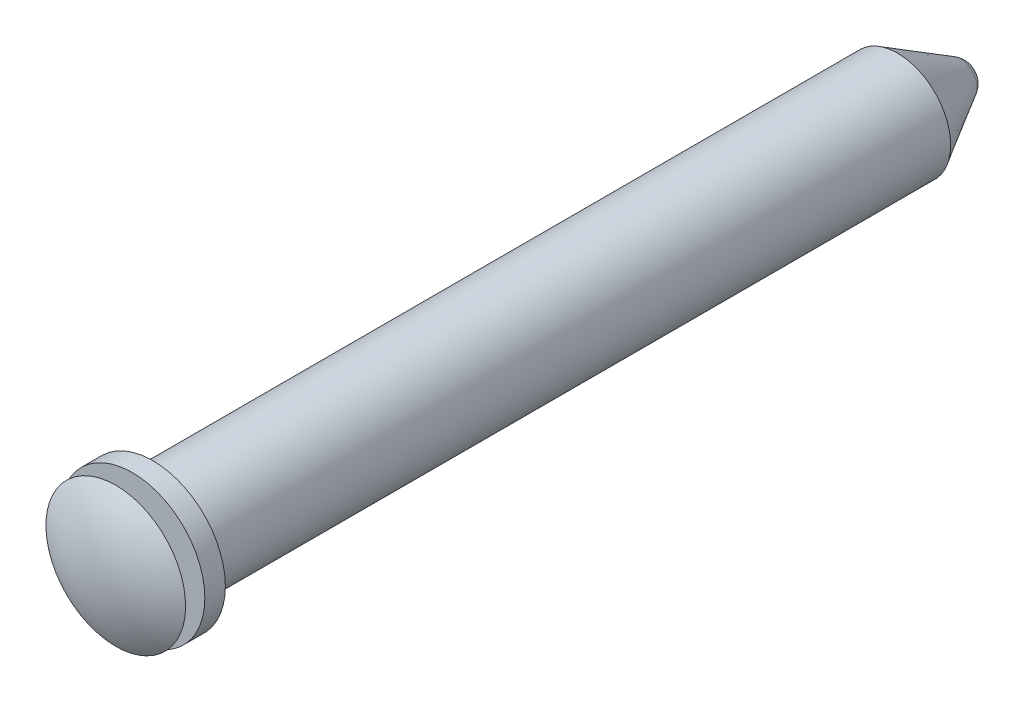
ISO-10303-21;
HEADER;
FILE_DESCRIPTION(('STEP AP214'),'2;1');
FILE_NAME('part.step','',(''),(''),'','','');
FILE_SCHEMA(('AUTOMOTIVE_DESIGN { 1 0 10303 214 1 1 1 1 }'));
ENDSEC;
DATA;
#1=APPLICATION_CONTEXT('core data for automotive mechanical design processes');
#2=APPLICATION_PROTOCOL_DEFINITION('international standard','automotive_design',2000,#1);
#3=PRODUCT_CONTEXT('',#1,'mechanical');
#4=PRODUCT('Part','Part','',(#3));
#5=PRODUCT_RELATED_PRODUCT_CATEGORY('part','',(#4));
#6=PRODUCT_DEFINITION_FORMATION('','',#4);
#7=PRODUCT_DEFINITION_CONTEXT('part definition',#1,'design');
#8=PRODUCT_DEFINITION('design','',#6,#7);
#9=PRODUCT_DEFINITION_SHAPE('','',#8);
#10=(LENGTH_UNIT() NAMED_UNIT(*) SI_UNIT(.MILLI.,.METRE.));
#11=(NAMED_UNIT(*) PLANE_ANGLE_UNIT() SI_UNIT($,.RADIAN.));
#12=(NAMED_UNIT(*) SI_UNIT($,.STERADIAN.) SOLID_ANGLE_UNIT());
#13=UNCERTAINTY_MEASURE_WITH_UNIT(LENGTH_MEASURE(1.E-05),#10,'distance_accuracy_value','');
#14=(GEOMETRIC_REPRESENTATION_CONTEXT(3) GLOBAL_UNCERTAINTY_ASSIGNED_CONTEXT((#13)) GLOBAL_UNIT_ASSIGNED_CONTEXT((#10,
#11,#12)) REPRESENTATION_CONTEXT('',''));
#15=CARTESIAN_POINT('',(0.,0.,0.));
#16=DIRECTION('',(0.,0.,1.));
#17=DIRECTION('',(1.,0.,0.));
#18=AXIS2_PLACEMENT_3D('',#15,#16,#17);
#19=CARTESIAN_POINT('',(0.,0.,-5.08));
#20=DIRECTION('',(0.,0.,1.));
#21=DIRECTION('',(0.,1.,0.));
#22=AXIS2_PLACEMENT_3D('',#19,#20,#21);
#23=SPHERICAL_SURFACE('',#22,5.08);
#24=CARTESIAN_POINT('',(0.,0.,-0.762));
#25=DIRECTION('',(0.,0.,1.));
#26=DIRECTION('',(1.,0.,0.));
#27=AXIS2_PLACEMENT_3D('',#24,#25,#26);
#28=CIRCLE('',#27,2.6760560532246);
#29=CARTESIAN_POINT('',(2.6760560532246,0.,-0.762));
#30=VERTEX_POINT('',#29);
#31=EDGE_CURVE('E10',#30,#30,#28,.T.);
#32=ORIENTED_EDGE('',*,*,#31,.T.);
#33=EDGE_LOOP('',(#32));
#34=FACE_BOUND('',#33,.T.);
#35=ADVANCED_FACE('F33',(#34),#23,.T.);
#36=CARTESIAN_POINT('',(0.,1.5875,-0.762));
#37=DIRECTION('',(0.,0.,1.));
#38=DIRECTION('',(1.,0.,0.));
#39=AXIS2_PLACEMENT_3D('',#36,#37,#38);
#40=PLANE('',#39);
#41=ORIENTED_EDGE('',*,*,#31,.F.);
#42=EDGE_LOOP('',(#41));
#43=FACE_BOUND('',#42,.T.);
#44=CARTESIAN_POINT('',(0.,0.,-0.762));
#45=DIRECTION('',(0.,0.,1.));
#46=DIRECTION('',(1.,0.,0.));
#47=AXIS2_PLACEMENT_3D('',#44,#45,#46);
#48=CIRCLE('',#47,1.5875);
#49=CARTESIAN_POINT('',(1.5875,0.,-0.762));
#50=VERTEX_POINT('',#49);
#51=EDGE_CURVE('E39',#50,#50,#48,.T.);
#52=ORIENTED_EDGE('',*,*,#51,.T.);
#53=EDGE_LOOP('',(#52));
#54=FACE_BOUND('',#53,.T.);
#55=ADVANCED_FACE('F80',(#43,#54),#40,.F.);
#56=CARTESIAN_POINT('',(0.,0.,0.));
#57=DIRECTION('',(0.,0.,1.));
#58=DIRECTION('',(1.,0.,0.));
#59=AXIS2_PLACEMENT_3D('',#56,#57,#58);
#60=CYLINDRICAL_SURFACE('',#59,1.5875);
#61=ORIENTED_EDGE('',*,*,#51,.F.);
#62=EDGE_LOOP('',(#61));
#63=FACE_BOUND('',#62,.T.);
#64=CARTESIAN_POINT('',(0.,0.,-1.397));
#65=DIRECTION('',(0.,0.,1.));
#66=DIRECTION('',(1.,0.,0.));
#67=AXIS2_PLACEMENT_3D('',#64,#65,#66);
#68=CIRCLE('',#67,1.5875);
#69=CARTESIAN_POINT('',(1.5875,0.,-1.397));
#70=VERTEX_POINT('',#69);
#71=EDGE_CURVE('E43',#70,#70,#68,.T.);
#72=ORIENTED_EDGE('',*,*,#71,.T.);
#73=EDGE_LOOP('',(#72));
#74=FACE_BOUND('',#73,.T.);
#75=ADVANCED_FACE('F84',(#63,#74),#60,.T.);
#76=CARTESIAN_POINT('',(0.,2.778125,-1.397));
#77=DIRECTION('',(0.,0.,-1.));
#78=DIRECTION('',(-1.,0.,0.));
#79=AXIS2_PLACEMENT_3D('',#76,#77,#78);
#80=PLANE('',#79);
#81=ORIENTED_EDGE('',*,*,#71,.F.);
#82=EDGE_LOOP('',(#81));
#83=FACE_BOUND('',#82,.T.);
#84=CARTESIAN_POINT('',(0.,0.,-1.397));
#85=DIRECTION('',(0.,0.,1.));
#86=DIRECTION('',(1.,0.,0.));
#87=AXIS2_PLACEMENT_3D('',#84,#85,#86);
#88=CIRCLE('',#87,2.778125);
#89=CARTESIAN_POINT('',(2.778125,0.,-1.397));
#90=VERTEX_POINT('',#89);
#91=EDGE_CURVE('E47',#90,#90,#88,.T.);
#92=ORIENTED_EDGE('',*,*,#91,.T.);
#93=EDGE_LOOP('',(#92));
#94=FACE_BOUND('',#93,.T.);
#95=ADVANCED_FACE('F89',(#83,#94),#80,.F.);
#96=CARTESIAN_POINT('',(0.,0.,0.));
#97=DIRECTION('',(0.,0.,1.));
#98=DIRECTION('',(1.,0.,0.));
#99=AXIS2_PLACEMENT_3D('',#96,#97,#98);
#100=CYLINDRICAL_SURFACE('',#99,2.778125);
#101=ORIENTED_EDGE('',*,*,#91,.F.);
#102=EDGE_LOOP('',(#101));
#103=FACE_BOUND('',#102,.T.);
#104=CARTESIAN_POINT('',(0.,0.,-2.1844));
#105=DIRECTION('',(0.,0.,1.));
#106=DIRECTION('',(1.,0.,0.));
#107=AXIS2_PLACEMENT_3D('',#104,#105,#106);
#108=CIRCLE('',#107,2.778125);
#109=CARTESIAN_POINT('',(2.778125,0.,-2.1844));
#110=VERTEX_POINT('',#109);
#111=EDGE_CURVE('E52',#110,#110,#108,.T.);
#112=ORIENTED_EDGE('',*,*,#111,.T.);
#113=EDGE_LOOP('',(#112));
#114=FACE_BOUND('',#113,.T.);
#115=ADVANCED_FACE('F95',(#103,#114),#100,.T.);
#116=CARTESIAN_POINT('',(0.,2.3368,-2.1844));
#117=DIRECTION('',(0.,0.,1.));
#118=DIRECTION('',(1.,0.,0.));
#119=AXIS2_PLACEMENT_3D('',#116,#117,#118);
#120=PLANE('',#119);
#121=ORIENTED_EDGE('',*,*,#111,.F.);
#122=EDGE_LOOP('',(#121));
#123=FACE_BOUND('',#122,.T.);
#124=CARTESIAN_POINT('',(0.,0.,-2.1844));
#125=DIRECTION('',(0.,0.,1.));
#126=DIRECTION('',(1.,0.,0.));
#127=AXIS2_PLACEMENT_3D('',#124,#125,#126);
#128=CIRCLE('',#127,2.3368);
#129=CARTESIAN_POINT('',(2.3368,0.,-2.1844));
#130=VERTEX_POINT('',#129);
#131=EDGE_CURVE('E55',#130,#130,#128,.T.);
#132=ORIENTED_EDGE('',*,*,#131,.T.);
#133=EDGE_LOOP('',(#132));
#134=FACE_BOUND('',#133,.T.);
#135=ADVANCED_FACE('F99',(#123,#134),#120,.F.);
#136=CARTESIAN_POINT('',(0.,0.,-2.4892));
#137=DIRECTION('',(0.,0.,1.));
#138=DIRECTION('',(1.,0.,0.));
#139=AXIS2_PLACEMENT_3D('',#136,#137,#138);
#140=TOROIDAL_SURFACE('',#139,2.3368,0.3048);
#141=ORIENTED_EDGE('',*,*,#131,.F.);
#142=EDGE_LOOP('',(#141));
#143=FACE_BOUND('',#142,.T.);
#144=CARTESIAN_POINT('',(0.,0.,-2.4892));
#145=DIRECTION('',(0.,0.,1.));
#146=DIRECTION('',(1.,0.,0.));
#147=AXIS2_PLACEMENT_3D('',#144,#145,#146);
#148=CIRCLE('',#147,2.032);
#149=CARTESIAN_POINT('',(2.032,0.,-2.4892));
#150=VERTEX_POINT('',#149);
#151=EDGE_CURVE('E58',#150,#150,#148,.T.);
#152=ORIENTED_EDGE('',*,*,#151,.T.);
#153=EDGE_LOOP('',(#152));
#154=FACE_BOUND('',#153,.T.);
#155=ADVANCED_FACE('F103',(#143,#154),#140,.F.);
#156=CARTESIAN_POINT('',(0.,0.,0.));
#157=DIRECTION('',(0.,0.,1.));
#158=DIRECTION('',(1.,0.,0.));
#159=AXIS2_PLACEMENT_3D('',#156,#157,#158);
#160=CYLINDRICAL_SURFACE('',#159,2.032);
#161=ORIENTED_EDGE('',*,*,#151,.F.);
#162=EDGE_LOOP('',(#161));
#163=FACE_BOUND('',#162,.T.);
#164=CARTESIAN_POINT('',(0.,0.,-30.724475));
#165=DIRECTION('',(0.,0.,1.));
#166=DIRECTION('',(1.,0.,0.));
#167=AXIS2_PLACEMENT_3D('',#164,#165,#166);
#168=CIRCLE('',#167,2.032);
#169=CARTESIAN_POINT('',(2.032,0.,-30.724475));
#170=VERTEX_POINT('',#169);
#171=EDGE_CURVE('E61',#170,#170,#168,.T.);
#172=ORIENTED_EDGE('',*,*,#171,.T.);
#173=EDGE_LOOP('',(#172));
#174=FACE_BOUND('',#173,.T.);
#175=ADVANCED_FACE('F76',(#163,#174),#160,.T.);
#176=CARTESIAN_POINT('',(0.,0.,-33.13189887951));
#177=DIRECTION('',(0.,0.,1.));
#178=DIRECTION('',(1.,0.,0.));
#179=AXIS2_PLACEMENT_3D('',#176,#177,#178);
#180=CONICAL_SURFACE('',#179,0.642073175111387,0.523598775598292);
#181=CARTESIAN_POINT('',(0.,0.,-33.13189887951));
#182=DIRECTION('',(0.,0.,1.));
#183=DIRECTION('',(1.,0.,0.));
#184=AXIS2_PLACEMENT_3D('',#181,#182,#183);
#185=CIRCLE('',#184,0.642073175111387);
#186=CARTESIAN_POINT('',(0.642073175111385,0.,-33.13189887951));
#187=VERTEX_POINT('',#186);
#188=EDGE_CURVE('E64',#187,#187,#185,.T.);
#189=CARTESIAN_POINT('',(2.032,0.,-30.724475));
#190=CARTESIAN_POINT('',(2.01752159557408,0.,-30.7495523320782));
#191=CARTESIAN_POINT('',(2.00304319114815,0.,-30.7746296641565));
#192=CARTESIAN_POINT('',(1.97408638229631,0.,-30.8247843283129));
#193=CARTESIAN_POINT('',(1.95960797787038,0.,-30.8498616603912));
#194=CARTESIAN_POINT('',(1.93065116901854,0.,-30.9000163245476));
#195=CARTESIAN_POINT('',(1.91617276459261,0.,-30.9250936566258));
#196=CARTESIAN_POINT('',(1.88721595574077,0.,-30.9752483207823));
#197=CARTESIAN_POINT('',(1.87273755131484,0.,-31.0003256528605));
#198=CARTESIAN_POINT('',(1.843780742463,0.,-31.050480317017));
#199=CARTESIAN_POINT('',(1.82930233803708,0.,-31.0755576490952));
#200=CARTESIAN_POINT('',(1.80034552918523,0.,-31.1257123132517));
#201=CARTESIAN_POINT('',(1.78586712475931,0.,-31.1507896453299));
#202=CARTESIAN_POINT('',(1.75691031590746,0.,-31.2009443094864));
#203=CARTESIAN_POINT('',(1.74243191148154,0.,-31.2260216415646));
#204=CARTESIAN_POINT('',(1.71347510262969,0.,-31.2761763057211));
#205=CARTESIAN_POINT('',(1.69899669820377,0.,-31.3012536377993));
#206=CARTESIAN_POINT('',(1.67003988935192,0.,-31.3514083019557));
#207=CARTESIAN_POINT('',(1.655561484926,0.,-31.376485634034));
#208=CARTESIAN_POINT('',(1.62660467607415,0.,-31.4266402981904));
#209=CARTESIAN_POINT('',(1.61212627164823,0.,-31.4517176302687));
#210=CARTESIAN_POINT('',(1.58316946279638,0.,-31.5018722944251));
#211=CARTESIAN_POINT('',(1.56869105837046,0.,-31.5269496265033));
#212=CARTESIAN_POINT('',(1.53973424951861,0.,-31.5771042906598));
#213=CARTESIAN_POINT('',(1.52525584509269,0.,-31.602181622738));
#214=CARTESIAN_POINT('',(1.49629903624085,0.,-31.6523362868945));
#215=CARTESIAN_POINT('',(1.48182063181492,0.,-31.6774136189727));
#216=CARTESIAN_POINT('',(1.45286382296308,0.,-31.7275682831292));
#217=CARTESIAN_POINT('',(1.43838541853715,0.,-31.7526456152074));
#218=CARTESIAN_POINT('',(1.40942860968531,0.,-31.8028002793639));
#219=CARTESIAN_POINT('',(1.39495020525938,0.,-31.8278776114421));
#220=CARTESIAN_POINT('',(1.36599339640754,0.,-31.8780322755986));
#221=CARTESIAN_POINT('',(1.35151499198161,0.,-31.9031096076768));
#222=CARTESIAN_POINT('',(1.32255818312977,0.,-31.9532642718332));
#223=CARTESIAN_POINT('',(1.30807977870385,0.,-31.9783416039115));
#224=CARTESIAN_POINT('',(1.279122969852,0.,-32.0284962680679));
#225=CARTESIAN_POINT('',(1.26464456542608,0.,-32.0535736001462));
#226=CARTESIAN_POINT('',(1.23568775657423,0.,-32.1037282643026));
#227=CARTESIAN_POINT('',(1.22120935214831,0.,-32.1288055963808));
#228=CARTESIAN_POINT('',(1.19225254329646,0.,-32.1789602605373));
#229=CARTESIAN_POINT('',(1.17777413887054,0.,-32.2040375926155));
#230=CARTESIAN_POINT('',(1.14881733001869,0.,-32.254192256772));
#231=CARTESIAN_POINT('',(1.13433892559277,0.,-32.2792695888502));
#232=CARTESIAN_POINT('',(1.10538211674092,0.,-32.3294242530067));
#233=CARTESIAN_POINT('',(1.090903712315,0.,-32.3545015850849));
#234=CARTESIAN_POINT('',(1.06194690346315,0.,-32.4046562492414));
#235=CARTESIAN_POINT('',(1.04746849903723,0.,-32.4297335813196));
#236=CARTESIAN_POINT('',(1.01851169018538,0.,-32.4798882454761));
#237=CARTESIAN_POINT('',(1.00403328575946,0.,-32.5049655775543));
#238=CARTESIAN_POINT('',(0.975076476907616,0.,-32.5551202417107));
#239=CARTESIAN_POINT('',(0.960598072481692,0.,-32.580197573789));
#240=CARTESIAN_POINT('',(0.931641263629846,0.,-32.6303522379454));
#241=CARTESIAN_POINT('',(0.917162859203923,0.,-32.6554295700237));
#242=CARTESIAN_POINT('',(0.888206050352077,0.,-32.7055842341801));
#243=CARTESIAN_POINT('',(0.873727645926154,0.,-32.7306615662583));
#244=CARTESIAN_POINT('',(0.844770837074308,0.,-32.7808162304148));
#245=CARTESIAN_POINT('',(0.830292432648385,0.,-32.805893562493));
#246=CARTESIAN_POINT('',(0.801335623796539,0.,-32.8560482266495));
#247=CARTESIAN_POINT('',(0.786857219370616,0.,-32.8811255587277));
#248=CARTESIAN_POINT('',(0.75790041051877,0.,-32.9312802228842));
#249=CARTESIAN_POINT('',(0.743422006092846,0.,-32.9563575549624));
#250=CARTESIAN_POINT('',(0.714465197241,0.,-33.0065122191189));
#251=CARTESIAN_POINT('',(0.699986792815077,0.,-33.0315895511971));
#252=CARTESIAN_POINT('',(0.671029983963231,0.,-33.0817442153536));
#253=CARTESIAN_POINT('',(0.656551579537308,0.,-33.1068215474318));
#254=CARTESIAN_POINT('',(0.642073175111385,0.,-33.13189887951));
#255=B_SPLINE_CURVE_WITH_KNOTS('',3,(#189,#190,#191,#192,#193,#194,#195,#196,#197,#198,#199,
#200,#201,#202,#203,#204,#205,#206,#207,#208,#209,#210,#211,#212,#213,#214,#215,#216,#217,#218,
#219,#220,#221,#222,#223,#224,#225,#226,#227,#228,#229,#230,#231,#232,#233,#234,#235,#236,#237,
#238,#239,#240,#241,#242,#243,#244,#245,#246,#247,#248,#249,#250,#251,#252,#253,#254),
.UNSPECIFIED.,.F.,.F.,(4,2,2,2,2,2,2,2,2,2,2,2,2,2,2,2,2,2,2,2,2,2,2,2,2,2,2,2,2,2,2,2,4),(0.,
0.0868704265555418,0.173740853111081,0.260611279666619,0.347481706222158,0.4343521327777,
0.521222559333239,0.608092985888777,0.694963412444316,0.781833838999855,0.868704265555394,
0.955574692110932,1.04244511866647,1.12931554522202,1.21618597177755,1.30305639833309,
1.38992682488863,1.47679725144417,1.56366767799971,1.65053810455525,1.73740853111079,
1.82427895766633,1.91114938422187,1.99801981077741,2.08489023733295,2.17176066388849,
2.25863109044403,2.34550151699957,2.4323719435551,2.51924237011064,2.60611279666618,
2.69298322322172,2.77985364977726),.UNSPECIFIED.);
#256=EDGE_CURVE('BSEAM68',#170,#187,#255,.T.);
#257=ORIENTED_EDGE('',*,*,#171,.F.);
#258=ORIENTED_EDGE('',*,*,#188,.T.);
#259=ORIENTED_EDGE('',*,*,#256,.T.);
#260=ORIENTED_EDGE('',*,*,#256,.F.);
#261=EDGE_LOOP('',(#257,#259,#258,#260));
#262=FACE_BOUND('',#261,.T.);
#263=ADVANCED_FACE('F68',(#262),#180,.T.);
#264=CARTESIAN_POINT('',(0.,0.,-32.76119775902));
#265=DIRECTION('',(0.,0.,1.));
#266=DIRECTION('',(0.,1.,0.));
#267=AXIS2_PLACEMENT_3D('',#264,#265,#266);
#268=SPHERICAL_SURFACE('',#267,0.74140224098);
#269=ORIENTED_EDGE('',*,*,#188,.F.);
#270=EDGE_LOOP('',(#269));
#271=FACE_BOUND('',#270,.T.);
#272=ADVANCED_FACE('F70',(#271),#268,.T.);
#273=CLOSED_SHELL('',(#35,#55,#75,#95,#115,#135,#155,#175,#263,#272));
#274=MANIFOLD_SOLID_BREP('B2',#273);
#275=ADVANCED_BREP_SHAPE_REPRESENTATION('',(#18,#274),#14);
#276=SHAPE_DEFINITION_REPRESENTATION(#9,#275);
ENDSEC;
END-ISO-10303-21;
